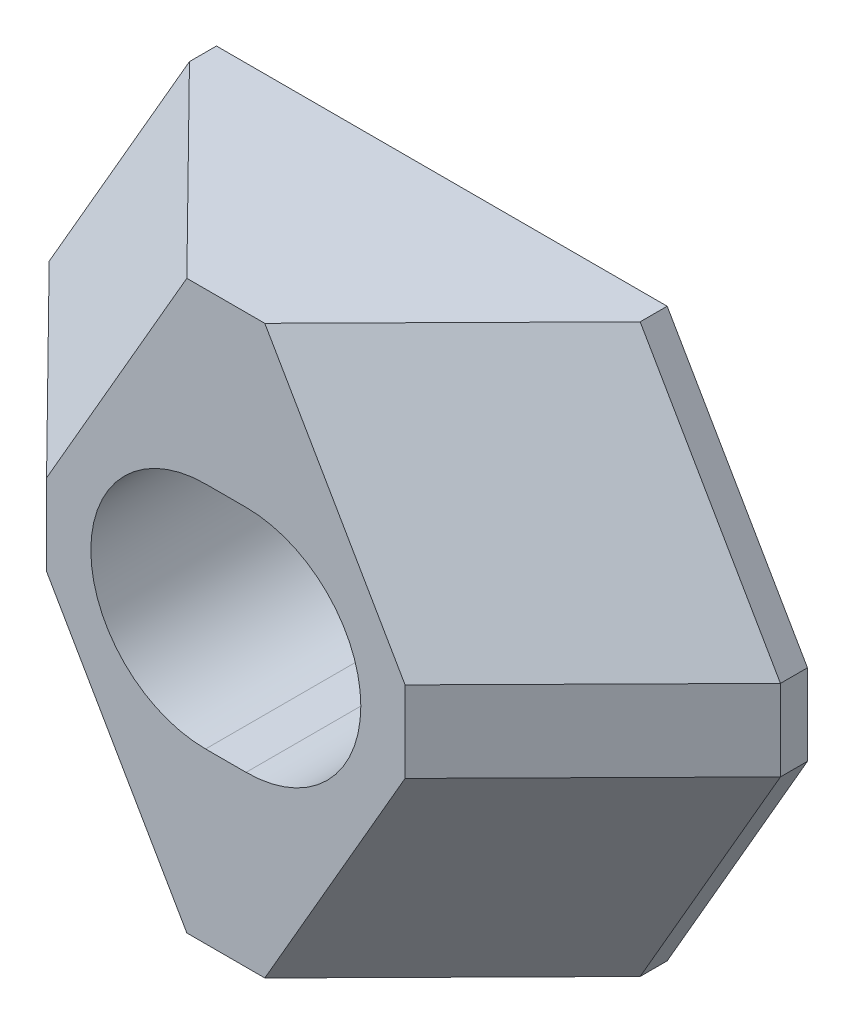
ISO-10303-21;
HEADER;
FILE_DESCRIPTION(('STEP AP214'),'2;1');
FILE_NAME('part.step','',(''),(''),'','','');
FILE_SCHEMA(('AUTOMOTIVE_DESIGN { 1 0 10303 214 1 1 1 1 }'));
ENDSEC;
DATA;
#1=APPLICATION_CONTEXT('core data for automotive mechanical design processes');
#2=APPLICATION_PROTOCOL_DEFINITION('international standard','automotive_design',2000,#1);
#3=PRODUCT_CONTEXT('',#1,'mechanical');
#4=PRODUCT('Part','Part','',(#3));
#5=PRODUCT_RELATED_PRODUCT_CATEGORY('part','',(#4));
#6=PRODUCT_DEFINITION_FORMATION('','',#4);
#7=PRODUCT_DEFINITION_CONTEXT('part definition',#1,'design');
#8=PRODUCT_DEFINITION('design','',#6,#7);
#9=PRODUCT_DEFINITION_SHAPE('','',#8);
#10=(LENGTH_UNIT() NAMED_UNIT(*) SI_UNIT(.MILLI.,.METRE.));
#11=(NAMED_UNIT(*) PLANE_ANGLE_UNIT() SI_UNIT($,.RADIAN.));
#12=(NAMED_UNIT(*) SI_UNIT($,.STERADIAN.) SOLID_ANGLE_UNIT());
#13=UNCERTAINTY_MEASURE_WITH_UNIT(LENGTH_MEASURE(1.E-05),#10,'distance_accuracy_value','');
#14=(GEOMETRIC_REPRESENTATION_CONTEXT(3) GLOBAL_UNCERTAINTY_ASSIGNED_CONTEXT((#13)) GLOBAL_UNIT_ASSIGNED_CONTEXT((#10,
#11,#12)) REPRESENTATION_CONTEXT('',''));
#15=CARTESIAN_POINT('',(0.,0.,0.));
#16=DIRECTION('',(0.,0.,1.));
#17=DIRECTION('',(1.,0.,0.));
#18=AXIS2_PLACEMENT_3D('',#15,#16,#17);
#19=CARTESIAN_POINT('',(-13.4803571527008,21.,14.));
#20=DIRECTION('',(0.,0.,-1.));
#21=DIRECTION('',(-1.,0.,0.));
#22=AXIS2_PLACEMENT_3D('',#19,#20,#21);
#23=PLANE('',#22);
#24=DIRECTION('',(1.,0.,0.));
#25=VECTOR('',#24,1.);
#26=CARTESIAN_POINT('',(-1.501,-8.5,14.));
#27=LINE('',#26,#25);
#28=CARTESIAN_POINT('',(-1.501,-8.5,14.));
#29=VERTEX_POINT('',#28);
#30=CARTESIAN_POINT('',(1.499,-8.5,14.));
#31=VERTEX_POINT('',#30);
#32=EDGE_CURVE('E193',#29,#31,#27,.T.);
#33=ORIENTED_EDGE('',*,*,#32,.F.);
#34=CARTESIAN_POINT('',(-1.501,0.,14.));
#35=DIRECTION('',(0.,0.,1.));
#36=DIRECTION('',(1.,0.,0.));
#37=AXIS2_PLACEMENT_3D('',#34,#35,#36);
#38=CIRCLE('',#37,8.5);
#39=CARTESIAN_POINT('',(-1.501,8.5,14.));
#40=VERTEX_POINT('',#39);
#41=EDGE_CURVE('E28',#40,#29,#38,.T.);
#42=ORIENTED_EDGE('',*,*,#41,.F.);
#43=DIRECTION('',(-1.,0.,0.));
#44=VECTOR('',#43,1.);
#45=CARTESIAN_POINT('',(-1.501,8.5,14.));
#46=LINE('',#45,#44);
#47=CARTESIAN_POINT('',(1.499,8.5,14.));
#48=VERTEX_POINT('',#47);
#49=EDGE_CURVE('E135',#48,#40,#46,.T.);
#50=ORIENTED_EDGE('',*,*,#49,.F.);
#51=CARTESIAN_POINT('',(1.499,0.,14.));
#52=DIRECTION('',(0.,0.,1.));
#53=DIRECTION('',(1.,0.,0.));
#54=AXIS2_PLACEMENT_3D('',#51,#52,#53);
#55=CIRCLE('',#54,8.5);
#56=EDGE_CURVE('E196',#31,#48,#55,.T.);
#57=ORIENTED_EDGE('',*,*,#56,.F.);
#58=EDGE_LOOP('',(#33,#42,#50,#57));
#59=FACE_BOUND('',#58,.T.);
#60=DIRECTION('',(-0.5,-0.866025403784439,0.));
#61=VECTOR('',#60,1.);
#62=CARTESIAN_POINT('',(16.9815181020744,3.41282812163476,14.));
#63=LINE('',#62,#61);
#64=CARTESIAN_POINT('',(13.2790700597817,-3.,14.));
#65=VERTEX_POINT('',#64);
#66=CARTESIAN_POINT('',(2.88676521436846,-21.,14.));
#67=VERTEX_POINT('',#66);
#68=EDGE_CURVE('E219',#65,#67,#63,.T.);
#69=ORIENTED_EDGE('',*,*,#68,.F.);
#70=DIRECTION('',(0.,-1.,0.));
#71=VECTOR('',#70,1.);
#72=CARTESIAN_POINT('',(13.2790700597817,21.,14.));
#73=LINE('',#72,#71);
#74=CARTESIAN_POINT('',(13.2790700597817,3.,14.));
#75=VERTEX_POINT('',#74);
#76=EDGE_CURVE('E221',#75,#65,#73,.T.);
#77=ORIENTED_EDGE('',*,*,#76,.F.);
#78=DIRECTION('',(0.5,-0.866025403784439,0.));
#79=VECTOR('',#78,1.);
#80=CARTESIAN_POINT('',(-1.20501537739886,28.0871718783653,14.));
#81=LINE('',#80,#79);
#82=CARTESIAN_POINT('',(2.88676521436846,21.,14.));
#83=VERTEX_POINT('',#82);
#84=EDGE_CURVE('E214',#83,#75,#81,.T.);
#85=ORIENTED_EDGE('',*,*,#84,.F.);
#86=DIRECTION('',(1.,0.,0.));
#87=VECTOR('',#86,1.);
#88=CARTESIAN_POINT('',(-13.4803571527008,21.,14.));
#89=LINE('',#88,#87);
#90=CARTESIAN_POINT('',(-2.88876521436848,21.,14.));
#91=VERTEX_POINT('',#90);
#92=EDGE_CURVE('E245',#91,#83,#89,.T.);
#93=ORIENTED_EDGE('',*,*,#92,.F.);
#94=DIRECTION('',(0.5,0.866025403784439,0.));
#95=VECTOR('',#94,1.);
#96=CARTESIAN_POINT('',(-5.53666319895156,16.4137061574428,14.));
#97=LINE('',#96,#95);
#98=CARTESIAN_POINT('',(-13.2810700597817,3.,14.));
#99=VERTEX_POINT('',#98);
#100=EDGE_CURVE('E36',#99,#91,#97,.T.);
#101=ORIENTED_EDGE('',*,*,#100,.F.);
#102=DIRECTION('',(0.,1.,0.));
#103=VECTOR('',#102,1.);
#104=CARTESIAN_POINT('',(-13.2810700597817,21.,14.));
#105=LINE('',#104,#103);
#106=CARTESIAN_POINT('',(-13.2810700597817,-3.,14.));
#107=VERTEX_POINT('',#106);
#108=EDGE_CURVE('E240',#107,#99,#105,.T.);
#109=ORIENTED_EDGE('',*,*,#108,.F.);
#110=DIRECTION('',(-0.5,0.866025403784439,0.));
#111=VECTOR('',#110,1.);
#112=CARTESIAN_POINT('',(-23.7231966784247,15.0862938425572,14.));
#113=LINE('',#112,#111);
#114=CARTESIAN_POINT('',(-2.88876521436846,-21.,14.));
#115=VERTEX_POINT('',#114);
#116=EDGE_CURVE('E238',#115,#107,#113,.T.);
#117=ORIENTED_EDGE('',*,*,#116,.F.);
#118=DIRECTION('',(1.,0.,0.));
#119=VECTOR('',#118,1.);
#120=CARTESIAN_POINT('',(-13.4803571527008,-21.,14.));
#121=LINE('',#120,#119);
#122=EDGE_CURVE('E242',#115,#67,#121,.T.);
#123=ORIENTED_EDGE('',*,*,#122,.T.);
#124=EDGE_LOOP('',(#69,#77,#85,#93,#101,#109,#117,#123));
#125=FACE_BOUND('',#124,.T.);
#126=ADVANCED_FACE('F14',(#59,#125),#23,.F.);
#127=CARTESIAN_POINT('',(0.,-21.,27.9593184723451));
#128=DIRECTION('',(0.,1.,0.));
#129=DIRECTION('',(0.,0.,1.));
#130=AXIS2_PLACEMENT_3D('',#127,#128,#129);
#131=PLANE('',#130);
#132=DIRECTION('',(0.702153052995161,0.,-0.712026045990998));
#133=VECTOR('',#132,1.);
#134=CARTESIAN_POINT('',(-5.51544351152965,-21.,22.5203524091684));
#135=LINE('',#134,#133);
#136=CARTESIAN_POINT('',(16.6926404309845,-21.,0.));
#137=VERTEX_POINT('',#136);
#138=EDGE_CURVE('E21',#67,#137,#135,.T.);
#139=ORIENTED_EDGE('',*,*,#138,.F.);
#140=ORIENTED_EDGE('',*,*,#122,.F.);
#141=DIRECTION('',(0.702153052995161,0.,0.712026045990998));
#142=VECTOR('',#141,1.);
#143=CARTESIAN_POINT('',(5.51442954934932,-21.,22.5213523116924));
#144=LINE('',#143,#142);
#145=CARTESIAN_POINT('',(-16.6946404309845,-21.,0.));
#146=VERTEX_POINT('',#145);
#147=EDGE_CURVE('E250',#146,#115,#144,.T.);
#148=ORIENTED_EDGE('',*,*,#147,.F.);
#149=DIRECTION('',(0.,0.,1.));
#150=VECTOR('',#149,1.);
#151=CARTESIAN_POINT('',(-16.6946404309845,-21.,-2.));
#152=LINE('',#151,#150);
#153=CARTESIAN_POINT('',(-16.6946404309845,-21.,-2.));
#154=VERTEX_POINT('',#153);
#155=EDGE_CURVE('E185',#154,#146,#152,.T.);
#156=ORIENTED_EDGE('',*,*,#155,.F.);
#157=DIRECTION('',(-1.,0.,0.));
#158=VECTOR('',#157,1.);
#159=CARTESIAN_POINT('',(16.6926404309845,-21.,-2.));
#160=LINE('',#159,#158);
#161=CARTESIAN_POINT('',(16.6926404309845,-21.,-2.));
#162=VERTEX_POINT('',#161);
#163=EDGE_CURVE('E160',#162,#154,#160,.T.);
#164=ORIENTED_EDGE('',*,*,#163,.F.);
#165=DIRECTION('',(0.,0.,1.));
#166=VECTOR('',#165,1.);
#167=CARTESIAN_POINT('',(16.6926404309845,-21.,-2.));
#168=LINE('',#167,#166);
#169=EDGE_CURVE('E187',#162,#137,#168,.T.);
#170=ORIENTED_EDGE('',*,*,#169,.T.);
#171=EDGE_LOOP('',(#139,#140,#148,#156,#164,#170));
#172=FACE_BOUND('',#171,.T.);
#173=ADVANCED_FACE('F265',(#172),#131,.F.);
#174=CARTESIAN_POINT('',(0.,21.,27.9593184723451));
#175=DIRECTION('',(0.,1.,0.));
#176=DIRECTION('',(0.,0.,1.));
#177=AXIS2_PLACEMENT_3D('',#174,#175,#176);
#178=PLANE('',#177);
#179=ORIENTED_EDGE('',*,*,#92,.T.);
#180=DIRECTION('',(0.702153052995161,0.,-0.712026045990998));
#181=VECTOR('',#180,1.);
#182=CARTESIAN_POINT('',(-5.51544351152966,21.,22.5203524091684));
#183=LINE('',#182,#181);
#184=CARTESIAN_POINT('',(16.6926404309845,21.,0.));
#185=VERTEX_POINT('',#184);
#186=EDGE_CURVE('E255',#83,#185,#183,.T.);
#187=ORIENTED_EDGE('',*,*,#186,.T.);
#188=DIRECTION('',(0.,0.,1.));
#189=VECTOR('',#188,1.);
#190=CARTESIAN_POINT('',(16.6926404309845,21.,-2.));
#191=LINE('',#190,#189);
#192=CARTESIAN_POINT('',(16.6926404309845,21.,-2.));
#193=VERTEX_POINT('',#192);
#194=EDGE_CURVE('E174',#193,#185,#191,.T.);
#195=ORIENTED_EDGE('',*,*,#194,.F.);
#196=DIRECTION('',(1.,0.,0.));
#197=VECTOR('',#196,1.);
#198=CARTESIAN_POINT('',(-16.6946404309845,21.,-2.));
#199=LINE('',#198,#197);
#200=CARTESIAN_POINT('',(-16.6946404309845,21.,-2.));
#201=VERTEX_POINT('',#200);
#202=EDGE_CURVE('E168',#201,#193,#199,.T.);
#203=ORIENTED_EDGE('',*,*,#202,.F.);
#204=DIRECTION('',(0.,0.,1.));
#205=VECTOR('',#204,1.);
#206=CARTESIAN_POINT('',(-16.6946404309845,21.,-2.));
#207=LINE('',#206,#205);
#208=CARTESIAN_POINT('',(-16.6946404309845,21.,0.));
#209=VERTEX_POINT('',#208);
#210=EDGE_CURVE('E176',#201,#209,#207,.T.);
#211=ORIENTED_EDGE('',*,*,#210,.T.);
#212=DIRECTION('',(0.702153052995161,0.,0.712026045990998));
#213=VECTOR('',#212,1.);
#214=CARTESIAN_POINT('',(5.51442954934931,21.,22.5213523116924));
#215=LINE('',#214,#213);
#216=EDGE_CURVE('E248',#209,#91,#215,.T.);
#217=ORIENTED_EDGE('',*,*,#216,.T.);
#218=EDGE_LOOP('',(#179,#187,#195,#203,#211,#217));
#219=FACE_BOUND('',#218,.T.);
#220=ADVANCED_FACE('F292',(#219),#178,.T.);
#221=CARTESIAN_POINT('',(-10.4723868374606,0.,16.8481761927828));
#222=DIRECTION('',(-0.712026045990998,0.,0.702153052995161));
#223=DIRECTION('',(0.702153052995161,0.,0.712026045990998));
#224=AXIS2_PLACEMENT_3D('',#221,#222,#223);
#225=PLANE('',#224);
#226=DIRECTION('',(-0.702153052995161,0.,-0.712026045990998));
#227=VECTOR('',#226,1.);
#228=CARTESIAN_POINT('',(-22.8933048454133,-3.,4.25260732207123));
#229=LINE('',#228,#227);
#230=CARTESIAN_POINT('',(-27.0869452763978,-3.,0.));
#231=VERTEX_POINT('',#230);
#232=EDGE_CURVE('E229',#107,#231,#229,.T.);
#233=ORIENTED_EDGE('',*,*,#232,.F.);
#234=ORIENTED_EDGE('',*,*,#108,.T.);
#235=DIRECTION('',(-0.702153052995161,0.,-0.712026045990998));
#236=VECTOR('',#235,1.);
#237=CARTESIAN_POINT('',(-22.8933048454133,3.,4.25260732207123));
#238=LINE('',#237,#236);
#239=CARTESIAN_POINT('',(-27.0869452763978,3.,0.));
#240=VERTEX_POINT('',#239);
#241=EDGE_CURVE('E223',#99,#240,#238,.T.);
#242=ORIENTED_EDGE('',*,*,#241,.T.);
#243=DIRECTION('',(0.,-1.,0.));
#244=VECTOR('',#243,1.);
#245=CARTESIAN_POINT('',(-27.0869452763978,21.,0.));
#246=LINE('',#245,#244);
#247=EDGE_CURVE('E252',#240,#231,#246,.T.);
#248=ORIENTED_EDGE('',*,*,#247,.T.);
#249=EDGE_LOOP('',(#233,#234,#242,#248));
#250=FACE_BOUND('',#249,.T.);
#251=ADVANCED_FACE('F277',(#250),#225,.T.);
#252=CARTESIAN_POINT('',(-22.8933048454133,-3.,4.25260732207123));
#253=DIRECTION('',(-0.658551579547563,-0.380214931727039,0.649420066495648));
#254=DIRECTION('',(0.702153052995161,0.,0.712026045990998));
#255=AXIS2_PLACEMENT_3D('',#252,#253,#254);
#256=PLANE('',#255);
#257=ORIENTED_EDGE('',*,*,#147,.T.);
#258=ORIENTED_EDGE('',*,*,#116,.T.);
#259=ORIENTED_EDGE('',*,*,#232,.T.);
#260=DIRECTION('',(0.5,-0.866025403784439,0.));
#261=VECTOR('',#260,1.);
#262=CARTESIAN_POINT('',(-23.9575138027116,-8.42033431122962,0.));
#263=LINE('',#262,#261);
#264=EDGE_CURVE('E235',#231,#146,#263,.T.);
#265=ORIENTED_EDGE('',*,*,#264,.T.);
#266=EDGE_LOOP('',(#257,#258,#259,#265));
#267=FACE_BOUND('',#266,.T.);
#268=ADVANCED_FACE('F275',(#267),#256,.T.);
#269=CARTESIAN_POINT('',(-22.8933048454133,3.,4.25260732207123));
#270=DIRECTION('',(-0.658551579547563,0.380214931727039,0.649420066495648));
#271=DIRECTION('',(0.702153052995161,0.,0.712026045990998));
#272=AXIS2_PLACEMENT_3D('',#269,#270,#271);
#273=PLANE('',#272);
#274=ORIENTED_EDGE('',*,*,#241,.F.);
#275=ORIENTED_EDGE('',*,*,#100,.T.);
#276=ORIENTED_EDGE('',*,*,#216,.F.);
#277=DIRECTION('',(-0.5,-0.866025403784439,0.));
#278=VECTOR('',#277,1.);
#279=CARTESIAN_POINT('',(-5.77098032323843,39.9203343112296,0.));
#280=LINE('',#279,#278);
#281=EDGE_CURVE('E233',#209,#240,#280,.T.);
#282=ORIENTED_EDGE('',*,*,#281,.T.);
#283=EDGE_LOOP('',(#274,#275,#276,#282));
#284=FACE_BOUND('',#283,.T.);
#285=ADVANCED_FACE('F289',(#284),#273,.T.);
#286=CARTESIAN_POINT('',(10.4703868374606,0.,16.8481761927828));
#287=DIRECTION('',(0.712026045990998,0.,0.702153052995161));
#288=DIRECTION('',(-0.702153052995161,0.,0.712026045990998));
#289=AXIS2_PLACEMENT_3D('',#286,#287,#288);
#290=PLANE('',#289);
#291=DIRECTION('',(0.702153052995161,0.,-0.712026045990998));
#292=VECTOR('',#291,1.);
#293=CARTESIAN_POINT('',(22.8913048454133,3.,4.25260732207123));
#294=LINE('',#293,#292);
#295=CARTESIAN_POINT('',(27.0849452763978,3.,0.));
#296=VERTEX_POINT('',#295);
#297=EDGE_CURVE('E136',#75,#296,#294,.T.);
#298=ORIENTED_EDGE('',*,*,#297,.F.);
#299=ORIENTED_EDGE('',*,*,#76,.T.);
#300=DIRECTION('',(0.702153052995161,0.,-0.712026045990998));
#301=VECTOR('',#300,1.);
#302=CARTESIAN_POINT('',(22.8913048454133,-3.,4.25260732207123));
#303=LINE('',#302,#301);
#304=CARTESIAN_POINT('',(27.0849452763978,-3.,0.));
#305=VERTEX_POINT('',#304);
#306=EDGE_CURVE('E209',#65,#305,#303,.T.);
#307=ORIENTED_EDGE('',*,*,#306,.T.);
#308=DIRECTION('',(0.,1.,0.));
#309=VECTOR('',#308,1.);
#310=CARTESIAN_POINT('',(27.0849452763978,21.,0.));
#311=LINE('',#310,#309);
#312=EDGE_CURVE('E9',#305,#296,#311,.T.);
#313=ORIENTED_EDGE('',*,*,#312,.T.);
#314=EDGE_LOOP('',(#298,#299,#307,#313));
#315=FACE_BOUND('',#314,.T.);
#316=ADVANCED_FACE('F302',(#315),#290,.T.);
#317=CARTESIAN_POINT('',(22.8913048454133,-3.,4.25260732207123));
#318=DIRECTION('',(0.658551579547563,-0.380214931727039,0.649420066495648));
#319=DIRECTION('',(-0.702153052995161,0.,0.712026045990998));
#320=AXIS2_PLACEMENT_3D('',#317,#318,#319);
#321=PLANE('',#320);
#322=ORIENTED_EDGE('',*,*,#306,.F.);
#323=ORIENTED_EDGE('',*,*,#68,.T.);
#324=ORIENTED_EDGE('',*,*,#138,.T.);
#325=DIRECTION('',(0.5,0.866025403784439,0.));
#326=VECTOR('',#325,1.);
#327=CARTESIAN_POINT('',(37.4560138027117,14.963217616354,0.));
#328=LINE('',#327,#326);
#329=EDGE_CURVE('E216',#137,#305,#328,.T.);
#330=ORIENTED_EDGE('',*,*,#329,.T.);
#331=EDGE_LOOP('',(#322,#323,#324,#330));
#332=FACE_BOUND('',#331,.T.);
#333=ADVANCED_FACE('F261',(#332),#321,.T.);
#334=CARTESIAN_POINT('',(22.8913048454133,3.,4.25260732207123));
#335=DIRECTION('',(0.658551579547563,0.380214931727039,0.649420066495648));
#336=DIRECTION('',(-0.702153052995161,0.,0.712026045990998));
#337=AXIS2_PLACEMENT_3D('',#334,#335,#336);
#338=PLANE('',#337);
#339=ORIENTED_EDGE('',*,*,#186,.F.);
#340=ORIENTED_EDGE('',*,*,#84,.T.);
#341=ORIENTED_EDGE('',*,*,#297,.T.);
#342=DIRECTION('',(-0.5,0.866025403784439,0.));
#343=VECTOR('',#342,1.);
#344=CARTESIAN_POINT('',(19.2694803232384,16.536782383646,0.));
#345=LINE('',#344,#343);
#346=EDGE_CURVE('E213',#296,#185,#345,.T.);
#347=ORIENTED_EDGE('',*,*,#346,.T.);
#348=EDGE_LOOP('',(#339,#340,#341,#347));
#349=FACE_BOUND('',#348,.T.);
#350=ADVANCED_FACE('F300',(#349),#338,.T.);
#351=CARTESIAN_POINT('',(-1.501,0.,0.));
#352=DIRECTION('',(0.,0.,1.));
#353=DIRECTION('',(1.,0.,0.));
#354=AXIS2_PLACEMENT_3D('',#351,#352,#353);
#355=CYLINDRICAL_SURFACE('',#354,8.5);
#356=ORIENTED_EDGE('',*,*,#41,.T.);
#357=DIRECTION('',(0.,0.,1.));
#358=VECTOR('',#357,1.);
#359=CARTESIAN_POINT('',(-1.501,-8.5,0.));
#360=LINE('',#359,#358);
#361=CARTESIAN_POINT('',(-1.501,-8.5,-2.));
#362=VERTEX_POINT('',#361);
#363=EDGE_CURVE('E142',#362,#29,#360,.T.);
#364=ORIENTED_EDGE('',*,*,#363,.F.);
#365=CARTESIAN_POINT('',(-1.501,0.,-2.));
#366=DIRECTION('',(0.,0.,-1.));
#367=DIRECTION('',(-1.,0.,0.));
#368=AXIS2_PLACEMENT_3D('',#365,#366,#367);
#369=CIRCLE('',#368,8.5);
#370=CARTESIAN_POINT('',(-1.501,8.5,-2.));
#371=VERTEX_POINT('',#370);
#372=EDGE_CURVE('E140',#362,#371,#369,.T.);
#373=ORIENTED_EDGE('',*,*,#372,.T.);
#374=DIRECTION('',(0.,0.,1.));
#375=VECTOR('',#374,1.);
#376=CARTESIAN_POINT('',(-1.501,8.5,0.));
#377=LINE('',#376,#375);
#378=EDGE_CURVE('E128',#371,#40,#377,.T.);
#379=ORIENTED_EDGE('',*,*,#378,.T.);
#380=EDGE_LOOP('',(#356,#364,#373,#379));
#381=FACE_BOUND('',#380,.T.);
#382=ADVANCED_FACE('F141',(#381),#355,.F.);
#383=CARTESIAN_POINT('',(-1.501,8.5,0.));
#384=DIRECTION('',(0.,1.,0.));
#385=DIRECTION('',(-1.,0.,0.));
#386=AXIS2_PLACEMENT_3D('',#383,#384,#385);
#387=PLANE('',#386);
#388=ORIENTED_EDGE('',*,*,#49,.T.);
#389=ORIENTED_EDGE('',*,*,#378,.F.);
#390=DIRECTION('',(1.,0.,0.));
#391=VECTOR('',#390,1.);
#392=CARTESIAN_POINT('',(1.499,8.5,-2.));
#393=LINE('',#392,#391);
#394=CARTESIAN_POINT('',(1.499,8.5,-2.));
#395=VERTEX_POINT('',#394);
#396=EDGE_CURVE('E132',#371,#395,#393,.T.);
#397=ORIENTED_EDGE('',*,*,#396,.T.);
#398=DIRECTION('',(0.,0.,1.));
#399=VECTOR('',#398,1.);
#400=CARTESIAN_POINT('',(1.499,8.5,0.));
#401=LINE('',#400,#399);
#402=EDGE_CURVE('E137',#395,#48,#401,.T.);
#403=ORIENTED_EDGE('',*,*,#402,.T.);
#404=EDGE_LOOP('',(#388,#389,#397,#403));
#405=FACE_BOUND('',#404,.T.);
#406=ADVANCED_FACE('F130',(#405),#387,.F.);
#407=CARTESIAN_POINT('',(1.499,0.,0.));
#408=DIRECTION('',(0.,0.,1.));
#409=DIRECTION('',(1.,0.,0.));
#410=AXIS2_PLACEMENT_3D('',#407,#408,#409);
#411=CYLINDRICAL_SURFACE('',#410,8.5);
#412=ORIENTED_EDGE('',*,*,#56,.T.);
#413=ORIENTED_EDGE('',*,*,#402,.F.);
#414=CARTESIAN_POINT('',(1.499,0.,-2.));
#415=DIRECTION('',(0.,0.,-1.));
#416=DIRECTION('',(-1.,0.,0.));
#417=AXIS2_PLACEMENT_3D('',#414,#415,#416);
#418=CIRCLE('',#417,8.5);
#419=CARTESIAN_POINT('',(1.499,-8.5,-2.));
#420=VERTEX_POINT('',#419);
#421=EDGE_CURVE('E149',#395,#420,#418,.T.);
#422=ORIENTED_EDGE('',*,*,#421,.T.);
#423=DIRECTION('',(0.,0.,1.));
#424=VECTOR('',#423,1.);
#425=CARTESIAN_POINT('',(1.499,-8.5,0.));
#426=LINE('',#425,#424);
#427=EDGE_CURVE('E201',#420,#31,#426,.T.);
#428=ORIENTED_EDGE('',*,*,#427,.T.);
#429=EDGE_LOOP('',(#412,#413,#422,#428));
#430=FACE_BOUND('',#429,.T.);
#431=ADVANCED_FACE('F342',(#430),#411,.F.);
#432=CARTESIAN_POINT('',(-1.501,-8.5,0.));
#433=DIRECTION('',(0.,-1.,0.));
#434=DIRECTION('',(1.,0.,0.));
#435=AXIS2_PLACEMENT_3D('',#432,#433,#434);
#436=PLANE('',#435);
#437=ORIENTED_EDGE('',*,*,#32,.T.);
#438=ORIENTED_EDGE('',*,*,#427,.F.);
#439=DIRECTION('',(-1.,0.,0.));
#440=VECTOR('',#439,1.);
#441=CARTESIAN_POINT('',(-1.501,-8.5,-2.));
#442=LINE('',#441,#440);
#443=EDGE_CURVE('E151',#420,#362,#442,.T.);
#444=ORIENTED_EDGE('',*,*,#443,.T.);
#445=ORIENTED_EDGE('',*,*,#363,.T.);
#446=EDGE_LOOP('',(#437,#438,#444,#445));
#447=FACE_BOUND('',#446,.T.);
#448=ADVANCED_FACE('F340',(#447),#436,.F.);
#449=CARTESIAN_POINT('',(27.0849452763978,-21.,-2.));
#450=DIRECTION('',(0.,0.,-1.));
#451=DIRECTION('',(-1.,0.,0.));
#452=AXIS2_PLACEMENT_3D('',#449,#450,#451);
#453=PLANE('',#452);
#454=DIRECTION('',(0.,-1.,0.));
#455=VECTOR('',#454,1.);
#456=CARTESIAN_POINT('',(27.0849452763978,3.,-2.));
#457=LINE('',#456,#455);
#458=CARTESIAN_POINT('',(27.0849452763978,3.,-2.));
#459=VERTEX_POINT('',#458);
#460=CARTESIAN_POINT('',(27.0849452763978,-3.,-2.));
#461=VERTEX_POINT('',#460);
#462=EDGE_CURVE('E155',#459,#461,#457,.T.);
#463=ORIENTED_EDGE('',*,*,#462,.T.);
#464=DIRECTION('',(-0.5,-0.866025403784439,0.));
#465=VECTOR('',#464,1.);
#466=CARTESIAN_POINT('',(27.0849452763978,-3.,-2.));
#467=LINE('',#466,#465);
#468=EDGE_CURVE('E158',#461,#162,#467,.T.);
#469=ORIENTED_EDGE('',*,*,#468,.T.);
#470=ORIENTED_EDGE('',*,*,#163,.T.);
#471=DIRECTION('',(-0.5,0.866025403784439,0.));
#472=VECTOR('',#471,1.);
#473=CARTESIAN_POINT('',(-16.6946404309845,-21.,-2.));
#474=LINE('',#473,#472);
#475=CARTESIAN_POINT('',(-27.0869452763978,-3.,-2.));
#476=VERTEX_POINT('',#475);
#477=EDGE_CURVE('E162',#154,#476,#474,.T.);
#478=ORIENTED_EDGE('',*,*,#477,.T.);
#479=DIRECTION('',(0.,1.,0.));
#480=VECTOR('',#479,1.);
#481=CARTESIAN_POINT('',(-27.0869452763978,-3.,-2.));
#482=LINE('',#481,#480);
#483=CARTESIAN_POINT('',(-27.0869452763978,3.,-2.));
#484=VERTEX_POINT('',#483);
#485=EDGE_CURVE('E164',#476,#484,#482,.T.);
#486=ORIENTED_EDGE('',*,*,#485,.T.);
#487=DIRECTION('',(0.5,0.866025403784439,0.));
#488=VECTOR('',#487,1.);
#489=CARTESIAN_POINT('',(-27.0869452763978,3.,-2.));
#490=LINE('',#489,#488);
#491=EDGE_CURVE('E166',#484,#201,#490,.T.);
#492=ORIENTED_EDGE('',*,*,#491,.T.);
#493=ORIENTED_EDGE('',*,*,#202,.T.);
#494=DIRECTION('',(0.5,-0.866025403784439,0.));
#495=VECTOR('',#494,1.);
#496=CARTESIAN_POINT('',(16.6926404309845,21.,-2.));
#497=LINE('',#496,#495);
#498=EDGE_CURVE('E170',#193,#459,#497,.T.);
#499=ORIENTED_EDGE('',*,*,#498,.T.);
#500=EDGE_LOOP('',(#463,#469,#470,#478,#486,#492,#493,#499));
#501=FACE_BOUND('',#500,.T.);
#502=ORIENTED_EDGE('',*,*,#396,.F.);
#503=ORIENTED_EDGE('',*,*,#372,.F.);
#504=ORIENTED_EDGE('',*,*,#443,.F.);
#505=ORIENTED_EDGE('',*,*,#421,.F.);
#506=EDGE_LOOP('',(#502,#503,#504,#505));
#507=FACE_BOUND('',#506,.T.);
#508=ADVANCED_FACE('F147',(#501,#507),#453,.T.);
#509=CARTESIAN_POINT('',(27.0849452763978,3.,-2.));
#510=DIRECTION('',(-1.,0.,0.));
#511=DIRECTION('',(0.,0.,1.));
#512=AXIS2_PLACEMENT_3D('',#509,#510,#511);
#513=PLANE('',#512);
#514=ORIENTED_EDGE('',*,*,#312,.F.);
#515=DIRECTION('',(0.,0.,1.));
#516=VECTOR('',#515,1.);
#517=CARTESIAN_POINT('',(27.0849452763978,-3.,-2.));
#518=LINE('',#517,#516);
#519=EDGE_CURVE('E190',#461,#305,#518,.T.);
#520=ORIENTED_EDGE('',*,*,#519,.F.);
#521=ORIENTED_EDGE('',*,*,#462,.F.);
#522=DIRECTION('',(0.,0.,1.));
#523=VECTOR('',#522,1.);
#524=CARTESIAN_POINT('',(27.0849452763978,3.,-2.));
#525=LINE('',#524,#523);
#526=EDGE_CURVE('E172',#459,#296,#525,.T.);
#527=ORIENTED_EDGE('',*,*,#526,.T.);
#528=EDGE_LOOP('',(#514,#520,#521,#527));
#529=FACE_BOUND('',#528,.T.);
#530=ADVANCED_FACE('F306',(#529),#513,.F.);
#531=CARTESIAN_POINT('',(27.0849452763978,-3.,-2.));
#532=DIRECTION('',(-0.866025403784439,0.5,0.));
#533=DIRECTION('',(-0.5,-0.866025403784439,0.));
#534=AXIS2_PLACEMENT_3D('',#531,#532,#533);
#535=PLANE('',#534);
#536=ORIENTED_EDGE('',*,*,#329,.F.);
#537=ORIENTED_EDGE('',*,*,#169,.F.);
#538=ORIENTED_EDGE('',*,*,#468,.F.);
#539=ORIENTED_EDGE('',*,*,#519,.T.);
#540=EDGE_LOOP('',(#536,#537,#538,#539));
#541=FACE_BOUND('',#540,.T.);
#542=ADVANCED_FACE('F319',(#541),#535,.F.);
#543=CARTESIAN_POINT('',(-16.6946404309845,-21.,-2.));
#544=DIRECTION('',(0.866025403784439,0.5,0.));
#545=DIRECTION('',(-0.5,0.866025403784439,0.));
#546=AXIS2_PLACEMENT_3D('',#543,#544,#545);
#547=PLANE('',#546);
#548=ORIENTED_EDGE('',*,*,#264,.F.);
#549=DIRECTION('',(0.,0.,1.));
#550=VECTOR('',#549,1.);
#551=CARTESIAN_POINT('',(-27.0869452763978,-3.,-2.));
#552=LINE('',#551,#550);
#553=EDGE_CURVE('E182',#476,#231,#552,.T.);
#554=ORIENTED_EDGE('',*,*,#553,.F.);
#555=ORIENTED_EDGE('',*,*,#477,.F.);
#556=ORIENTED_EDGE('',*,*,#155,.T.);
#557=EDGE_LOOP('',(#548,#554,#555,#556));
#558=FACE_BOUND('',#557,.T.);
#559=ADVANCED_FACE('F317',(#558),#547,.F.);
#560=CARTESIAN_POINT('',(-27.0869452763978,-3.,-2.));
#561=DIRECTION('',(1.,0.,0.));
#562=DIRECTION('',(0.,0.,-1.));
#563=AXIS2_PLACEMENT_3D('',#560,#561,#562);
#564=PLANE('',#563);
#565=ORIENTED_EDGE('',*,*,#247,.F.);
#566=DIRECTION('',(0.,0.,1.));
#567=VECTOR('',#566,1.);
#568=CARTESIAN_POINT('',(-27.0869452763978,3.,-2.));
#569=LINE('',#568,#567);
#570=EDGE_CURVE('E179',#484,#240,#569,.T.);
#571=ORIENTED_EDGE('',*,*,#570,.F.);
#572=ORIENTED_EDGE('',*,*,#485,.F.);
#573=ORIENTED_EDGE('',*,*,#553,.T.);
#574=EDGE_LOOP('',(#565,#571,#572,#573));
#575=FACE_BOUND('',#574,.T.);
#576=ADVANCED_FACE('F281',(#575),#564,.F.);
#577=CARTESIAN_POINT('',(-27.0869452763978,3.,-2.));
#578=DIRECTION('',(0.866025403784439,-0.5,0.));
#579=DIRECTION('',(0.5,0.866025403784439,0.));
#580=AXIS2_PLACEMENT_3D('',#577,#578,#579);
#581=PLANE('',#580);
#582=ORIENTED_EDGE('',*,*,#281,.F.);
#583=ORIENTED_EDGE('',*,*,#210,.F.);
#584=ORIENTED_EDGE('',*,*,#491,.F.);
#585=ORIENTED_EDGE('',*,*,#570,.T.);
#586=EDGE_LOOP('',(#582,#583,#584,#585));
#587=FACE_BOUND('',#586,.T.);
#588=ADVANCED_FACE('F287',(#587),#581,.F.);
#589=CARTESIAN_POINT('',(16.6926404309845,21.,-2.));
#590=DIRECTION('',(-0.866025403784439,-0.5,0.));
#591=DIRECTION('',(0.5,-0.866025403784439,0.));
#592=AXIS2_PLACEMENT_3D('',#589,#590,#591);
#593=PLANE('',#592);
#594=ORIENTED_EDGE('',*,*,#346,.F.);
#595=ORIENTED_EDGE('',*,*,#526,.F.);
#596=ORIENTED_EDGE('',*,*,#498,.F.);
#597=ORIENTED_EDGE('',*,*,#194,.T.);
#598=EDGE_LOOP('',(#594,#595,#596,#597));
#599=FACE_BOUND('',#598,.T.);
#600=ADVANCED_FACE('F311',(#599),#593,.F.);
#601=CLOSED_SHELL('',(#126,#173,#220,#251,#268,#285,#316,#333,#350,#382,#406,#431,#448,#508,
#530,#542,#559,#576,#588,#600));
#602=MANIFOLD_SOLID_BREP('B1',#601);
#603=ADVANCED_BREP_SHAPE_REPRESENTATION('',(#18,#602),#14);
#604=SHAPE_DEFINITION_REPRESENTATION(#9,#603);
ENDSEC;
END-ISO-10303-21;
